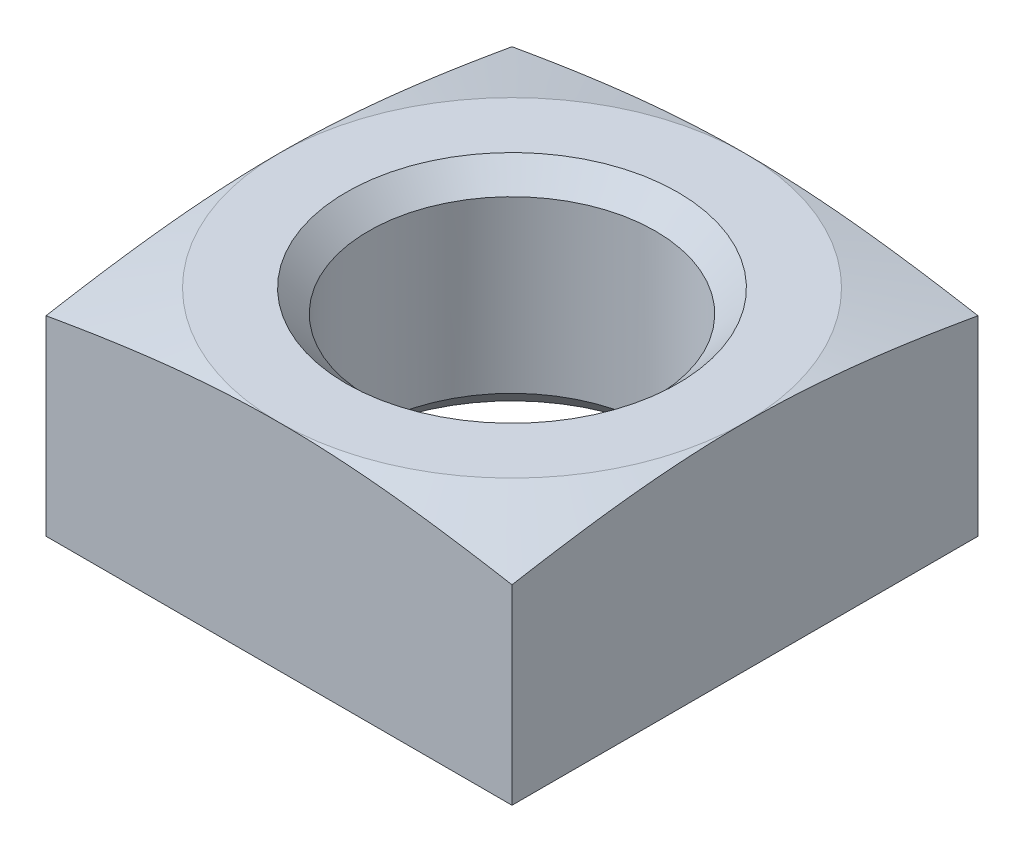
from build123d import *

# Parameters (mm, degrees)
SKETCH8_W           = 13
SKETCH8_H           = 6
BOSS_EXTRUDE2_DEPTH = 6.5
SKETCH11_R          = 4
CUT_EXTRUDE1_DEPTH  = 6
CHAMFER1_SIZE       = 0.625


with BuildPart() as part:
    # Sketch8 → Boss-Extrude2 (new, symmetric)
    with BuildSketch(Plane(origin=(0, 0, 0), x_dir=(0, 0, -1), z_dir=(1, 0, 0))):
        Rectangle(SKETCH8_W, SKETCH8_H)
    extrude(amount=BOSS_EXTRUDE2_DEPTH, both=True)

    # Sketch10 → Cut-Revolve1 (revolve, cut)
    with BuildSketch(Plane(origin=(0, 0, 0), x_dir=(0, 0, -1), z_dir=(1, 0, 0))):
        Polygon((-6.5, 3), (-9.3, 3), (-9.3, 2.3), align=None)
    revolve(axis=Axis((0, 59.838437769, 0), (0, -1, 0)), mode=Mode.SUBTRACT)

    # Sketch11 → Cut-Extrude1 (cut)
    with BuildSketch(Plane(origin=(0, 3, 0), x_dir=(1, 0, 0), z_dir=(0, 1, 0))):
        with Locations(Location((0, 0, 0), (0, 0, 270))):
            Circle(SKETCH11_R)
    extrude(amount=-CUT_EXTRUDE1_DEPTH, mode=Mode.SUBTRACT)

    # Chamfer1
    chamfer1_edges = [part.edges().sort_by_distance(p)[0] for p in [
        (0, 3, -4),
        (0, -3, -4),
    ]]
    chamfer(chamfer1_edges, length=CHAMFER1_SIZE)


solid = part.part
